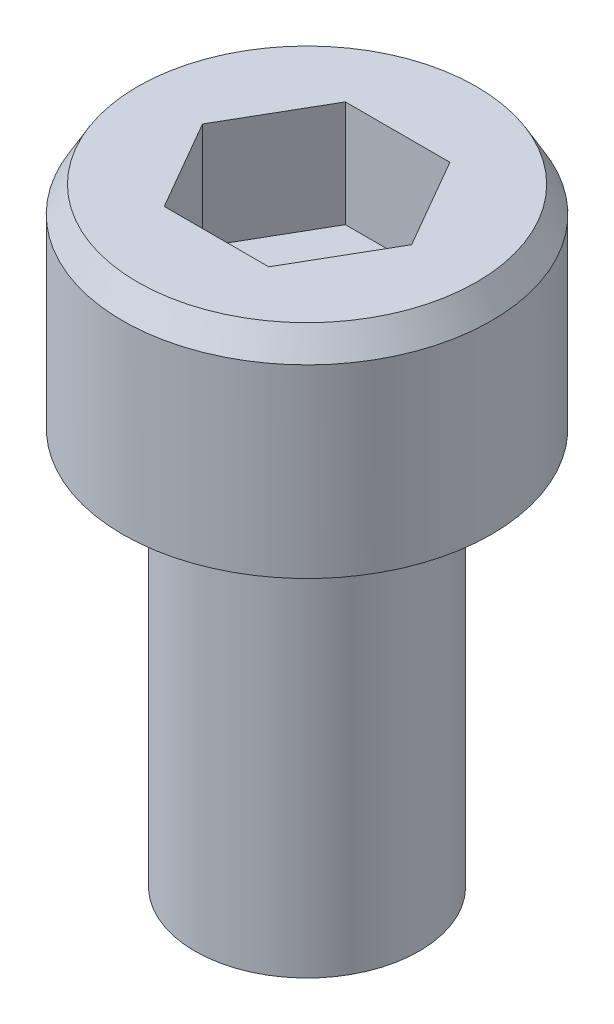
ISO-10303-21;
HEADER;
FILE_DESCRIPTION(('STEP AP214'),'2;1');
FILE_NAME('part.step','',(''),(''),'','','');
FILE_SCHEMA(('AUTOMOTIVE_DESIGN { 1 0 10303 214 1 1 1 1 }'));
ENDSEC;
DATA;
#1=APPLICATION_CONTEXT('core data for automotive mechanical design processes');
#2=APPLICATION_PROTOCOL_DEFINITION('international standard','automotive_design',2000,#1);
#3=PRODUCT_CONTEXT('',#1,'mechanical');
#4=PRODUCT('Part','Part','',(#3));
#5=PRODUCT_RELATED_PRODUCT_CATEGORY('part','',(#4));
#6=PRODUCT_DEFINITION_FORMATION('','',#4);
#7=PRODUCT_DEFINITION_CONTEXT('part definition',#1,'design');
#8=PRODUCT_DEFINITION('design','',#6,#7);
#9=PRODUCT_DEFINITION_SHAPE('','',#8);
#10=(LENGTH_UNIT() NAMED_UNIT(*) SI_UNIT(.MILLI.,.METRE.));
#11=(NAMED_UNIT(*) PLANE_ANGLE_UNIT() SI_UNIT($,.RADIAN.));
#12=(NAMED_UNIT(*) SI_UNIT($,.STERADIAN.) SOLID_ANGLE_UNIT());
#13=UNCERTAINTY_MEASURE_WITH_UNIT(LENGTH_MEASURE(1.E-05),#10,'distance_accuracy_value','');
#14=(GEOMETRIC_REPRESENTATION_CONTEXT(3) GLOBAL_UNCERTAINTY_ASSIGNED_CONTEXT((#13)) GLOBAL_UNIT_ASSIGNED_CONTEXT((#10,
#11,#12)) REPRESENTATION_CONTEXT('',''));
#15=CARTESIAN_POINT('',(0.,0.,0.));
#16=DIRECTION('',(0.,0.,1.));
#17=DIRECTION('',(1.,0.,0.));
#18=AXIS2_PLACEMENT_3D('',#15,#16,#17);
#19=CARTESIAN_POINT('',(0.,6.0706,0.));
#20=DIRECTION('',(0.,-1.,0.));
#21=DIRECTION('',(0.,0.,-1.));
#22=AXIS2_PLACEMENT_3D('',#19,#20,#21);
#23=CYLINDRICAL_SURFACE('',#22,1.7145);
#24=CARTESIAN_POINT('',(0.,0.229135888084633,0.));
#25=DIRECTION('',(0.,1.,0.));
#26=DIRECTION('',(0.,0.,1.));
#27=AXIS2_PLACEMENT_3D('',#24,#25,#26);
#28=CIRCLE('',#27,1.7145);
#29=CARTESIAN_POINT('',(0.,0.229135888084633,1.7145));
#30=VERTEX_POINT('',#29);
#31=EDGE_CURVE('E38',#30,#30,#28,.T.);
#32=ORIENTED_EDGE('',*,*,#31,.T.);
#33=EDGE_LOOP('',(#32));
#34=FACE_BOUND('',#33,.T.);
#35=CARTESIAN_POINT('',(0.,6.0706,0.));
#36=DIRECTION('',(0.,1.,0.));
#37=DIRECTION('',(0.,0.,1.));
#38=AXIS2_PLACEMENT_3D('',#35,#36,#37);
#39=CIRCLE('',#38,1.7145);
#40=CARTESIAN_POINT('',(0.,6.0706,1.7145));
#41=VERTEX_POINT('',#40);
#42=EDGE_CURVE('E132',#41,#41,#39,.T.);
#43=ORIENTED_EDGE('',*,*,#42,.F.);
#44=EDGE_LOOP('',(#43));
#45=FACE_BOUND('',#44,.T.);
#46=ADVANCED_FACE('F30',(#34,#45),#23,.T.);
#47=CARTESIAN_POINT('',(0.,0.,0.));
#48=DIRECTION('',(0.,1.,0.));
#49=DIRECTION('',(0.,0.,1.));
#50=AXIS2_PLACEMENT_3D('',#47,#48,#49);
#51=PLANE('',#50);
#52=CARTESIAN_POINT('',(0.,0.,0.));
#53=DIRECTION('',(0.,1.,0.));
#54=DIRECTION('',(0.,0.,1.));
#55=AXIS2_PLACEMENT_3D('',#52,#53,#54);
#56=CIRCLE('',#55,1.317625);
#57=CARTESIAN_POINT('',(0.,0.,1.317625));
#58=VERTEX_POINT('',#57);
#59=EDGE_CURVE('E11',#58,#58,#56,.F.);
#60=ORIENTED_EDGE('',*,*,#59,.T.);
#61=EDGE_LOOP('',(#60));
#62=FACE_BOUND('',#61,.T.);
#63=ADVANCED_FACE('F170',(#62),#51,.F.);
#64=CARTESIAN_POINT('',(0.,6.0706,0.));
#65=DIRECTION('',(0.,1.,0.));
#66=DIRECTION('',(0.,0.,1.));
#67=AXIS2_PLACEMENT_3D('',#64,#65,#66);
#68=PLANE('',#67);
#69=CARTESIAN_POINT('',(0.,6.0706,0.));
#70=DIRECTION('',(0.,1.,0.));
#71=DIRECTION('',(0.,0.,1.));
#72=AXIS2_PLACEMENT_3D('',#69,#70,#71);
#73=CIRCLE('',#72,2.422525);
#74=CARTESIAN_POINT('',(0.,6.0706,2.422525));
#75=VERTEX_POINT('',#74);
#76=EDGE_CURVE('E146',#75,#75,#73,.F.);
#77=ORIENTED_EDGE('',*,*,#76,.T.);
#78=EDGE_LOOP('',(#77));
#79=FACE_BOUND('',#78,.T.);
#80=ORIENTED_EDGE('',*,*,#42,.T.);
#81=EDGE_LOOP('',(#80));
#82=FACE_BOUND('',#81,.T.);
#83=ADVANCED_FACE('F175',(#79,#82),#68,.F.);
#84=CARTESIAN_POINT('',(0.,9.525,0.));
#85=DIRECTION('',(0.,-1.,0.));
#86=DIRECTION('',(0.,0.,-1.));
#87=AXIS2_PLACEMENT_3D('',#84,#85,#86);
#88=CYLINDRICAL_SURFACE('',#87,2.8194);
#89=CARTESIAN_POINT('',(0.,6.29973588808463,0.));
#90=DIRECTION('',(0.,1.,0.));
#91=DIRECTION('',(0.,0.,1.));
#92=AXIS2_PLACEMENT_3D('',#89,#90,#91);
#93=CIRCLE('',#92,2.8194);
#94=CARTESIAN_POINT('',(0.,6.29973588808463,2.8194));
#95=VERTEX_POINT('',#94);
#96=EDGE_CURVE('E143',#95,#95,#93,.T.);
#97=ORIENTED_EDGE('',*,*,#96,.T.);
#98=EDGE_LOOP('',(#97));
#99=FACE_BOUND('',#98,.T.);
#100=CARTESIAN_POINT('',(0.,9.128125,0.));
#101=DIRECTION('',(0.,1.,0.));
#102=DIRECTION('',(0.,0.,1.));
#103=AXIS2_PLACEMENT_3D('',#100,#101,#102);
#104=CIRCLE('',#103,2.8194);
#105=CARTESIAN_POINT('',(0.,9.128125,-2.8194));
#106=VERTEX_POINT('',#105);
#107=EDGE_CURVE('E140',#106,#106,#104,.F.);
#108=ORIENTED_EDGE('',*,*,#107,.T.);
#109=EDGE_LOOP('',(#108));
#110=FACE_BOUND('',#109,.T.);
#111=ADVANCED_FACE('F186',(#99,#110),#88,.T.);
#112=CARTESIAN_POINT('',(0.,9.525,0.));
#113=DIRECTION('',(0.,1.,0.));
#114=DIRECTION('',(0.,0.,1.));
#115=AXIS2_PLACEMENT_3D('',#112,#113,#114);
#116=PLANE('',#115);
#117=DIRECTION('',(0.500000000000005,0.,0.866025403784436));
#118=VECTOR('',#117,1.);
#119=CARTESIAN_POINT('',(-0.799225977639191,9.525,1.3843));
#120=LINE('',#119,#118);
#121=CARTESIAN_POINT('',(-1.5984519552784,9.525,0.));
#122=VERTEX_POINT('',#121);
#123=CARTESIAN_POINT('',(-0.799225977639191,9.525,1.3843));
#124=VERTEX_POINT('',#123);
#125=EDGE_CURVE('E45',#122,#124,#120,.T.);
#126=ORIENTED_EDGE('',*,*,#125,.F.);
#127=DIRECTION('',(-0.499999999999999,0.,0.866025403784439));
#128=VECTOR('',#127,1.);
#129=CARTESIAN_POINT('',(-1.5984519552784,9.525,0.));
#130=LINE('',#129,#128);
#131=CARTESIAN_POINT('',(-0.799225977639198,9.525,-1.3843));
#132=VERTEX_POINT('',#131);
#133=EDGE_CURVE('E128',#132,#122,#130,.T.);
#134=ORIENTED_EDGE('',*,*,#133,.F.);
#135=DIRECTION('',(-1.,0.,0.));
#136=VECTOR('',#135,1.);
#137=CARTESIAN_POINT('',(-0.799225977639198,9.525,-1.3843));
#138=LINE('',#137,#136);
#139=CARTESIAN_POINT('',(0.799225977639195,9.525,-1.3843));
#140=VERTEX_POINT('',#139);
#141=EDGE_CURVE('E126',#140,#132,#138,.T.);
#142=ORIENTED_EDGE('',*,*,#141,.F.);
#143=DIRECTION('',(-0.500000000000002,0.,-0.866025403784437));
#144=VECTOR('',#143,1.);
#145=CARTESIAN_POINT('',(0.799225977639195,9.525,-1.3843));
#146=LINE('',#145,#144);
#147=CARTESIAN_POINT('',(1.5984519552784,9.525,0.));
#148=VERTEX_POINT('',#147);
#149=EDGE_CURVE('E93',#148,#140,#146,.T.);
#150=ORIENTED_EDGE('',*,*,#149,.F.);
#151=DIRECTION('',(0.500000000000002,0.,-0.866025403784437));
#152=VECTOR('',#151,1.);
#153=CARTESIAN_POINT('',(1.5984519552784,9.525,0.));
#154=LINE('',#153,#152);
#155=CARTESIAN_POINT('',(0.799225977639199,9.525,1.3843));
#156=VERTEX_POINT('',#155);
#157=EDGE_CURVE('E122',#156,#148,#154,.T.);
#158=ORIENTED_EDGE('',*,*,#157,.F.);
#159=DIRECTION('',(1.,0.,0.));
#160=VECTOR('',#159,1.);
#161=CARTESIAN_POINT('',(0.799225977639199,9.525,1.3843));
#162=LINE('',#161,#160);
#163=EDGE_CURVE('E119',#124,#156,#162,.T.);
#164=ORIENTED_EDGE('',*,*,#163,.F.);
#165=EDGE_LOOP('',(#126,#134,#142,#150,#158,#164));
#166=FACE_BOUND('',#165,.T.);
#167=CARTESIAN_POINT('',(0.,9.525,0.));
#168=DIRECTION('',(0.,1.,0.));
#169=DIRECTION('',(0.,0.,1.));
#170=AXIS2_PLACEMENT_3D('',#167,#168,#169);
#171=CIRCLE('',#170,2.59026411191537);
#172=CARTESIAN_POINT('',(0.,9.525,-2.59026411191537));
#173=VERTEX_POINT('',#172);
#174=EDGE_CURVE('E149',#173,#173,#171,.T.);
#175=ORIENTED_EDGE('',*,*,#174,.T.);
#176=EDGE_LOOP('',(#175));
#177=FACE_BOUND('',#176,.T.);
#178=ADVANCED_FACE('F181',(#166,#177),#116,.T.);
#179=CARTESIAN_POINT('',(0.,6.29973588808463,0.));
#180=DIRECTION('',(0.,1.,0.));
#181=DIRECTION('',(0.,0.,1.));
#182=AXIS2_PLACEMENT_3D('',#179,#180,#181);
#183=CONICAL_SURFACE('',#182,2.8194,1.0471975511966);
#184=ORIENTED_EDGE('',*,*,#76,.F.);
#185=EDGE_LOOP('',(#184));
#186=FACE_BOUND('',#185,.T.);
#187=ORIENTED_EDGE('',*,*,#96,.F.);
#188=EDGE_LOOP('',(#187));
#189=FACE_BOUND('',#188,.T.);
#190=ADVANCED_FACE('F166',(#186,#189),#183,.T.);
#191=CARTESIAN_POINT('',(0.,9.525,0.));
#192=DIRECTION('',(0.,-1.,0.));
#193=DIRECTION('',(0.,0.,-1.));
#194=AXIS2_PLACEMENT_3D('',#191,#192,#193);
#195=CONICAL_SURFACE('',#194,2.59026411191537,0.523598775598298);
#196=CARTESIAN_POINT('',(0.,9.128125,-2.8194));
#197=CARTESIAN_POINT('',(0.,9.13225911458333,-2.81701316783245));
#198=CARTESIAN_POINT('',(0.,9.13639322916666,-2.8146263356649));
#199=CARTESIAN_POINT('',(0.,9.14466145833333,-2.80985267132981));
#200=CARTESIAN_POINT('',(0.,9.14879557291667,-2.80746583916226));
#201=CARTESIAN_POINT('',(0.,9.15706380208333,-2.80269217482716));
#202=CARTESIAN_POINT('',(0.,9.16119791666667,-2.80030534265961));
#203=CARTESIAN_POINT('',(0.,9.16946614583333,-2.79553167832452));
#204=CARTESIAN_POINT('',(0.,9.17360026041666,-2.79314484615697));
#205=CARTESIAN_POINT('',(0.,9.18186848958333,-2.78837118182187));
#206=CARTESIAN_POINT('',(0.,9.18600260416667,-2.78598434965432));
#207=CARTESIAN_POINT('',(0.,9.19427083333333,-2.78121068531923));
#208=CARTESIAN_POINT('',(0.,9.19840494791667,-2.77882385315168));
#209=CARTESIAN_POINT('',(0.,9.20667317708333,-2.77405018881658));
#210=CARTESIAN_POINT('',(0.,9.21080729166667,-2.77166335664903));
#211=CARTESIAN_POINT('',(0.,9.21907552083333,-2.76688969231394));
#212=CARTESIAN_POINT('',(0.,9.22320963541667,-2.76450286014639));
#213=CARTESIAN_POINT('',(0.,9.23147786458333,-2.75972919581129));
#214=CARTESIAN_POINT('',(0.,9.23561197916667,-2.75734236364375));
#215=CARTESIAN_POINT('',(0.,9.24388020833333,-2.75256869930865));
#216=CARTESIAN_POINT('',(0.,9.24801432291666,-2.7501818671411));
#217=CARTESIAN_POINT('',(0.,9.25628255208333,-2.745408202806));
#218=CARTESIAN_POINT('',(0.,9.26041666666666,-2.74302137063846));
#219=CARTESIAN_POINT('',(0.,9.26868489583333,-2.73824770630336));
#220=CARTESIAN_POINT('',(0.,9.27281901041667,-2.73586087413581));
#221=CARTESIAN_POINT('',(0.,9.28108723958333,-2.73108720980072));
#222=CARTESIAN_POINT('',(0.,9.28522135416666,-2.72870037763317));
#223=CARTESIAN_POINT('',(0.,9.29348958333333,-2.72392671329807));
#224=CARTESIAN_POINT('',(0.,9.29762369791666,-2.72153988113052));
#225=CARTESIAN_POINT('',(0.,9.30589192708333,-2.71676621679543));
#226=CARTESIAN_POINT('',(0.,9.31002604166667,-2.71437938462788));
#227=CARTESIAN_POINT('',(0.,9.31829427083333,-2.70960572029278));
#228=CARTESIAN_POINT('',(0.,9.32242838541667,-2.70721888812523));
#229=CARTESIAN_POINT('',(0.,9.33069661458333,-2.70244522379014));
#230=CARTESIAN_POINT('',(0.,9.33483072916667,-2.70005839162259));
#231=CARTESIAN_POINT('',(0.,9.34309895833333,-2.69528472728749));
#232=CARTESIAN_POINT('',(0.,9.34723307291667,-2.69289789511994));
#233=CARTESIAN_POINT('',(0.,9.35550130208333,-2.68812423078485));
#234=CARTESIAN_POINT('',(0.,9.35963541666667,-2.6857373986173));
#235=CARTESIAN_POINT('',(0.,9.36790364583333,-2.6809637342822));
#236=CARTESIAN_POINT('',(0.,9.37203776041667,-2.67857690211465));
#237=CARTESIAN_POINT('',(0.,9.38030598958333,-2.67380323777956));
#238=CARTESIAN_POINT('',(0.,9.38444010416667,-2.67141640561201));
#239=CARTESIAN_POINT('',(0.,9.39270833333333,-2.66664274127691));
#240=CARTESIAN_POINT('',(0.,9.39684244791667,-2.66425590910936));
#241=CARTESIAN_POINT('',(0.,9.40511067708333,-2.65948224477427));
#242=CARTESIAN_POINT('',(0.,9.40924479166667,-2.65709541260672));
#243=CARTESIAN_POINT('',(0.,9.41751302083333,-2.65232174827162));
#244=CARTESIAN_POINT('',(0.,9.42164713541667,-2.64993491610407));
#245=CARTESIAN_POINT('',(0.,9.42991536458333,-2.64516125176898));
#246=CARTESIAN_POINT('',(0.,9.43404947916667,-2.64277441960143));
#247=CARTESIAN_POINT('',(0.,9.44231770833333,-2.63800075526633));
#248=CARTESIAN_POINT('',(0.,9.44645182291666,-2.63561392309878));
#249=CARTESIAN_POINT('',(0.,9.45472005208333,-2.63084025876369));
#250=CARTESIAN_POINT('',(0.,9.45885416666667,-2.62845342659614));
#251=CARTESIAN_POINT('',(0.,9.46712239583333,-2.62367976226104));
#252=CARTESIAN_POINT('',(0.,9.47125651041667,-2.6212929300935));
#253=CARTESIAN_POINT('',(0.,9.47952473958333,-2.6165192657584));
#254=CARTESIAN_POINT('',(0.,9.48365885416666,-2.61413243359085));
#255=CARTESIAN_POINT('',(0.,9.49192708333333,-2.60935876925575));
#256=CARTESIAN_POINT('',(0.,9.49606119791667,-2.60697193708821));
#257=CARTESIAN_POINT('',(0.,9.50432942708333,-2.60219827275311));
#258=CARTESIAN_POINT('',(0.,9.50846354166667,-2.59981144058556));
#259=CARTESIAN_POINT('',(0.,9.51673177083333,-2.59503777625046));
#260=CARTESIAN_POINT('',(0.,9.52086588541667,-2.59265094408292));
#261=CARTESIAN_POINT('',(0.,9.525,-2.59026411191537));
#262=B_SPLINE_CURVE_WITH_KNOTS('',3,(#196,#197,#198,#199,#200,#201,#202,#203,#204,#205,#206,
#207,#208,#209,#210,#211,#212,#213,#214,#215,#216,#217,#218,#219,#220,#221,#222,#223,#224,#225,
#226,#227,#228,#229,#230,#231,#232,#233,#234,#235,#236,#237,#238,#239,#240,#241,#242,#243,#244,
#245,#246,#247,#248,#249,#250,#251,#252,#253,#254,#255,#256,#257,#258,#259,#260,#261),
.UNSPECIFIED.,.F.,.F.,(4,2,2,2,2,2,2,2,2,2,2,2,2,2,2,2,2,2,2,2,2,2,2,2,2,2,2,2,2,2,2,2,4),(0.,
0.0143209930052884,0.0286419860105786,0.0429629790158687,0.0572839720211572,0.0716049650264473,
0.0859259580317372,0.100246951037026,0.114567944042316,0.128888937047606,0.143209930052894,
0.157530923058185,0.171851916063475,0.186172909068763,0.200493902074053,0.214814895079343,
0.229135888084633,0.243456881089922,0.257777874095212,0.272098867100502,0.286419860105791,
0.300740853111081,0.315061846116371,0.329382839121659,0.343703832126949,0.358024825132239,
0.372345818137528,0.386666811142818,0.400987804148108,0.415308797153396,0.429629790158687,
0.443950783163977,0.458271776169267),.UNSPECIFIED.);
#263=EDGE_CURVE('BSEAM158',#106,#173,#262,.T.);
#264=ORIENTED_EDGE('',*,*,#107,.F.);
#265=ORIENTED_EDGE('',*,*,#174,.F.);
#266=ORIENTED_EDGE('',*,*,#263,.T.);
#267=ORIENTED_EDGE('',*,*,#263,.F.);
#268=EDGE_LOOP('',(#264,#266,#265,#267));
#269=FACE_BOUND('',#268,.T.);
#270=ADVANCED_FACE('F158',(#269),#195,.T.);
#271=CARTESIAN_POINT('',(0.,0.229135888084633,0.));
#272=DIRECTION('',(0.,1.,0.));
#273=DIRECTION('',(0.,0.,1.));
#274=AXIS2_PLACEMENT_3D('',#271,#272,#273);
#275=CONICAL_SURFACE('',#274,1.7145,1.0471975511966);
#276=ORIENTED_EDGE('',*,*,#59,.F.);
#277=EDGE_LOOP('',(#276));
#278=FACE_BOUND('',#277,.T.);
#279=ORIENTED_EDGE('',*,*,#31,.F.);
#280=EDGE_LOOP('',(#279));
#281=FACE_BOUND('',#280,.T.);
#282=ADVANCED_FACE('F32',(#278,#281),#275,.T.);
#283=CARTESIAN_POINT('',(-0.799225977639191,7.8994,1.3843));
#284=DIRECTION('',(-0.866025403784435,0.,0.500000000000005));
#285=DIRECTION('',(0.500000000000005,0.,0.866025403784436));
#286=AXIS2_PLACEMENT_3D('',#283,#284,#285);
#287=PLANE('',#286);
#288=ORIENTED_EDGE('',*,*,#125,.T.);
#289=DIRECTION('',(0.,1.,0.));
#290=VECTOR('',#289,1.);
#291=CARTESIAN_POINT('',(-0.799225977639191,7.8994,1.3843));
#292=LINE('',#291,#290);
#293=CARTESIAN_POINT('',(-0.799225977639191,7.8994,1.3843));
#294=VERTEX_POINT('',#293);
#295=EDGE_CURVE('E75',#294,#124,#292,.T.);
#296=ORIENTED_EDGE('',*,*,#295,.F.);
#297=DIRECTION('',(0.500000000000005,0.,0.866025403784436));
#298=VECTOR('',#297,1.);
#299=CARTESIAN_POINT('',(-0.799225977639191,7.8994,1.3843));
#300=LINE('',#299,#298);
#301=CARTESIAN_POINT('',(-1.5984519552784,7.8994,0.));
#302=VERTEX_POINT('',#301);
#303=EDGE_CURVE('E130',#302,#294,#300,.T.);
#304=ORIENTED_EDGE('',*,*,#303,.F.);
#305=DIRECTION('',(0.,1.,0.));
#306=VECTOR('',#305,1.);
#307=CARTESIAN_POINT('',(-1.5984519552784,7.8994,0.));
#308=LINE('',#307,#306);
#309=EDGE_CURVE('E53',#302,#122,#308,.T.);
#310=ORIENTED_EDGE('',*,*,#309,.T.);
#311=EDGE_LOOP('',(#288,#296,#304,#310));
#312=FACE_BOUND('',#311,.T.);
#313=ADVANCED_FACE('F157',(#312),#287,.F.);
#314=CARTESIAN_POINT('',(-1.5984519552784,7.8994,0.));
#315=DIRECTION('',(-0.866025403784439,0.,-0.499999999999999));
#316=DIRECTION('',(-0.499999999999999,0.,0.866025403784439));
#317=AXIS2_PLACEMENT_3D('',#314,#315,#316);
#318=PLANE('',#317);
#319=ORIENTED_EDGE('',*,*,#133,.T.);
#320=ORIENTED_EDGE('',*,*,#309,.F.);
#321=DIRECTION('',(-0.499999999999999,0.,0.866025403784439));
#322=VECTOR('',#321,1.);
#323=CARTESIAN_POINT('',(-1.5984519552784,7.8994,0.));
#324=LINE('',#323,#322);
#325=CARTESIAN_POINT('',(-0.799225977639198,7.8994,-1.3843));
#326=VERTEX_POINT('',#325);
#327=EDGE_CURVE('E105',#326,#302,#324,.T.);
#328=ORIENTED_EDGE('',*,*,#327,.F.);
#329=DIRECTION('',(0.,1.,0.));
#330=VECTOR('',#329,1.);
#331=CARTESIAN_POINT('',(-0.799225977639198,7.8994,-1.3843));
#332=LINE('',#331,#330);
#333=EDGE_CURVE('E97',#326,#132,#332,.T.);
#334=ORIENTED_EDGE('',*,*,#333,.T.);
#335=EDGE_LOOP('',(#319,#320,#328,#334));
#336=FACE_BOUND('',#335,.T.);
#337=ADVANCED_FACE('F164',(#336),#318,.F.);
#338=CARTESIAN_POINT('',(-0.799225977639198,7.8994,-1.3843));
#339=DIRECTION('',(0.,0.,-1.));
#340=DIRECTION('',(-1.,0.,0.));
#341=AXIS2_PLACEMENT_3D('',#338,#339,#340);
#342=PLANE('',#341);
#343=ORIENTED_EDGE('',*,*,#141,.T.);
#344=ORIENTED_EDGE('',*,*,#333,.F.);
#345=DIRECTION('',(-1.,0.,0.));
#346=VECTOR('',#345,1.);
#347=CARTESIAN_POINT('',(-0.799225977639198,7.8994,-1.3843));
#348=LINE('',#347,#346);
#349=CARTESIAN_POINT('',(0.799225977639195,7.8994,-1.3843));
#350=VERTEX_POINT('',#349);
#351=EDGE_CURVE('E101',#350,#326,#348,.T.);
#352=ORIENTED_EDGE('',*,*,#351,.F.);
#353=DIRECTION('',(0.,1.,0.));
#354=VECTOR('',#353,1.);
#355=CARTESIAN_POINT('',(0.799225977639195,7.8994,-1.3843));
#356=LINE('',#355,#354);
#357=EDGE_CURVE('E86',#350,#140,#356,.T.);
#358=ORIENTED_EDGE('',*,*,#357,.T.);
#359=EDGE_LOOP('',(#343,#344,#352,#358));
#360=FACE_BOUND('',#359,.T.);
#361=ADVANCED_FACE('F102',(#360),#342,.F.);
#362=CARTESIAN_POINT('',(0.799225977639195,7.8994,-1.3843));
#363=DIRECTION('',(0.866025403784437,0.,-0.500000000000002));
#364=DIRECTION('',(-0.500000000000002,0.,-0.866025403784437));
#365=AXIS2_PLACEMENT_3D('',#362,#363,#364);
#366=PLANE('',#365);
#367=ORIENTED_EDGE('',*,*,#149,.T.);
#368=ORIENTED_EDGE('',*,*,#357,.F.);
#369=DIRECTION('',(-0.500000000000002,0.,-0.866025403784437));
#370=VECTOR('',#369,1.);
#371=CARTESIAN_POINT('',(0.799225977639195,7.8994,-1.3843));
#372=LINE('',#371,#370);
#373=CARTESIAN_POINT('',(1.5984519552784,7.8994,0.));
#374=VERTEX_POINT('',#373);
#375=EDGE_CURVE('E90',#374,#350,#372,.T.);
#376=ORIENTED_EDGE('',*,*,#375,.F.);
#377=DIRECTION('',(0.,1.,0.));
#378=VECTOR('',#377,1.);
#379=CARTESIAN_POINT('',(1.5984519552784,7.8994,0.));
#380=LINE('',#379,#378);
#381=EDGE_CURVE('E98',#374,#148,#380,.T.);
#382=ORIENTED_EDGE('',*,*,#381,.T.);
#383=EDGE_LOOP('',(#367,#368,#376,#382));
#384=FACE_BOUND('',#383,.T.);
#385=ADVANCED_FACE('F88',(#384),#366,.F.);
#386=CARTESIAN_POINT('',(1.5984519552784,7.8994,0.));
#387=DIRECTION('',(0.866025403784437,0.,0.500000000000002));
#388=DIRECTION('',(0.500000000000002,0.,-0.866025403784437));
#389=AXIS2_PLACEMENT_3D('',#386,#387,#388);
#390=PLANE('',#389);
#391=ORIENTED_EDGE('',*,*,#157,.T.);
#392=ORIENTED_EDGE('',*,*,#381,.F.);
#393=DIRECTION('',(0.500000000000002,0.,-0.866025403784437));
#394=VECTOR('',#393,1.);
#395=CARTESIAN_POINT('',(1.5984519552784,7.8994,0.));
#396=LINE('',#395,#394);
#397=CARTESIAN_POINT('',(0.799225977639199,7.8994,1.3843));
#398=VERTEX_POINT('',#397);
#399=EDGE_CURVE('E111',#398,#374,#396,.T.);
#400=ORIENTED_EDGE('',*,*,#399,.F.);
#401=DIRECTION('',(0.,1.,0.));
#402=VECTOR('',#401,1.);
#403=CARTESIAN_POINT('',(0.799225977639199,7.8994,1.3843));
#404=LINE('',#403,#402);
#405=EDGE_CURVE('E135',#398,#156,#404,.T.);
#406=ORIENTED_EDGE('',*,*,#405,.T.);
#407=EDGE_LOOP('',(#391,#392,#400,#406));
#408=FACE_BOUND('',#407,.T.);
#409=ADVANCED_FACE('F208',(#408),#390,.F.);
#410=CARTESIAN_POINT('',(0.799225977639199,7.8994,1.3843));
#411=DIRECTION('',(0.,0.,1.));
#412=DIRECTION('',(1.,0.,0.));
#413=AXIS2_PLACEMENT_3D('',#410,#411,#412);
#414=PLANE('',#413);
#415=ORIENTED_EDGE('',*,*,#163,.T.);
#416=ORIENTED_EDGE('',*,*,#405,.F.);
#417=DIRECTION('',(1.,0.,0.));
#418=VECTOR('',#417,1.);
#419=CARTESIAN_POINT('',(0.799225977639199,7.8994,1.3843));
#420=LINE('',#419,#418);
#421=EDGE_CURVE('E113',#294,#398,#420,.T.);
#422=ORIENTED_EDGE('',*,*,#421,.F.);
#423=ORIENTED_EDGE('',*,*,#295,.T.);
#424=EDGE_LOOP('',(#415,#416,#422,#423));
#425=FACE_BOUND('',#424,.T.);
#426=ADVANCED_FACE('F205',(#425),#414,.F.);
#427=CARTESIAN_POINT('',(0.,7.8994,2.76859999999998));
#428=DIRECTION('',(0.,1.,0.));
#429=DIRECTION('',(0.,0.,1.));
#430=AXIS2_PLACEMENT_3D('',#427,#428,#429);
#431=PLANE('',#430);
#432=ORIENTED_EDGE('',*,*,#303,.T.);
#433=ORIENTED_EDGE('',*,*,#421,.T.);
#434=ORIENTED_EDGE('',*,*,#399,.T.);
#435=ORIENTED_EDGE('',*,*,#375,.T.);
#436=ORIENTED_EDGE('',*,*,#351,.T.);
#437=ORIENTED_EDGE('',*,*,#327,.T.);
#438=EDGE_LOOP('',(#432,#433,#434,#435,#436,#437));
#439=FACE_BOUND('',#438,.T.);
#440=ADVANCED_FACE('F108',(#439),#431,.T.);
#441=CLOSED_SHELL('',(#46,#63,#83,#111,#178,#190,#270,#282,#313,#337,#361,#385,#409,#426,#440));
#442=MANIFOLD_SOLID_BREP('B2',#441);
#443=ADVANCED_BREP_SHAPE_REPRESENTATION('',(#18,#442),#14);
#444=SHAPE_DEFINITION_REPRESENTATION(#9,#443);
ENDSEC;
END-ISO-10303-21;
